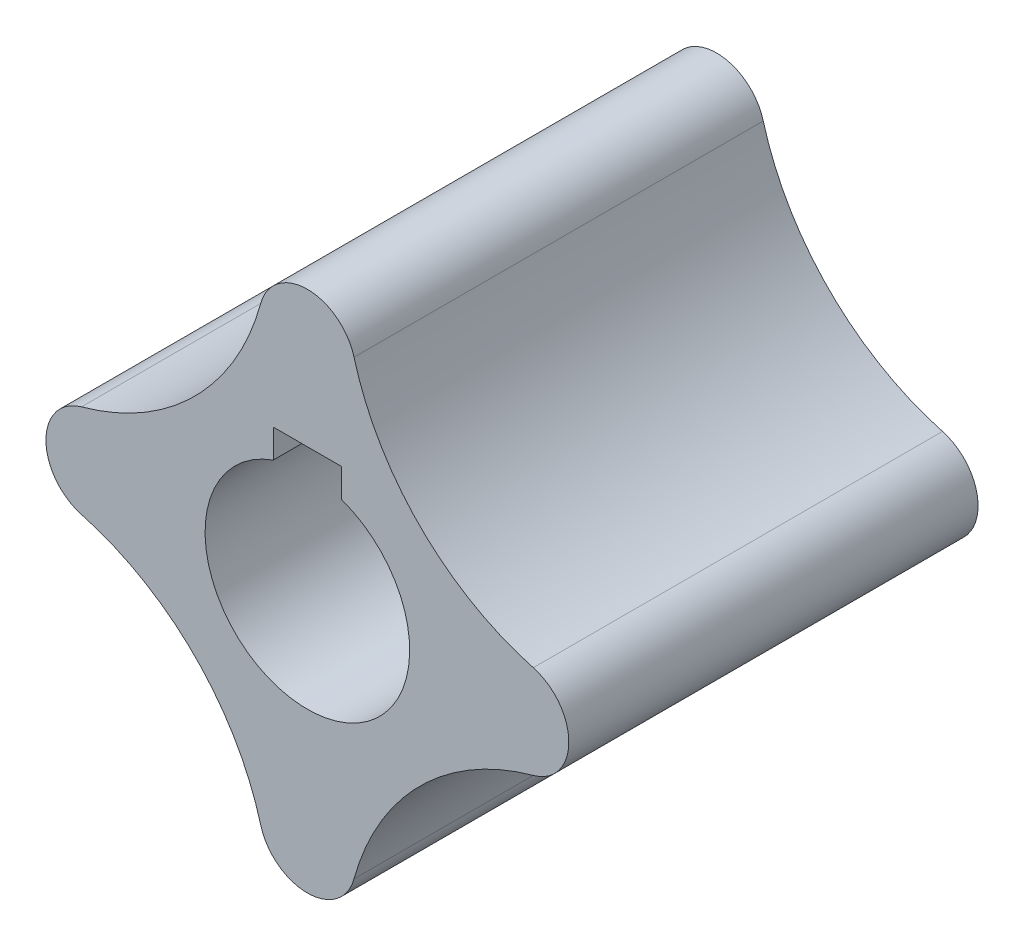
ISO-10303-21;
HEADER;
FILE_DESCRIPTION(('STEP AP214'),'2;1');
FILE_NAME('part.step','',(''),(''),'','','');
FILE_SCHEMA(('AUTOMOTIVE_DESIGN { 1 0 10303 214 1 1 1 1 }'));
ENDSEC;
DATA;
#1=APPLICATION_CONTEXT('core data for automotive mechanical design processes');
#2=APPLICATION_PROTOCOL_DEFINITION('international standard','automotive_design',2000,#1);
#3=PRODUCT_CONTEXT('',#1,'mechanical');
#4=PRODUCT('Part','Part','',(#3));
#5=PRODUCT_RELATED_PRODUCT_CATEGORY('part','',(#4));
#6=PRODUCT_DEFINITION_FORMATION('','',#4);
#7=PRODUCT_DEFINITION_CONTEXT('part definition',#1,'design');
#8=PRODUCT_DEFINITION('design','',#6,#7);
#9=PRODUCT_DEFINITION_SHAPE('','',#8);
#10=(LENGTH_UNIT() NAMED_UNIT(*) SI_UNIT(.MILLI.,.METRE.));
#11=(NAMED_UNIT(*) PLANE_ANGLE_UNIT() SI_UNIT($,.RADIAN.));
#12=(NAMED_UNIT(*) SI_UNIT($,.STERADIAN.) SOLID_ANGLE_UNIT());
#13=UNCERTAINTY_MEASURE_WITH_UNIT(LENGTH_MEASURE(1.E-05),#10,'distance_accuracy_value','');
#14=(GEOMETRIC_REPRESENTATION_CONTEXT(3) GLOBAL_UNCERTAINTY_ASSIGNED_CONTEXT((#13)) GLOBAL_UNIT_ASSIGNED_CONTEXT((#10,
#11,#12)) REPRESENTATION_CONTEXT('',''));
#15=CARTESIAN_POINT('',(0.,0.,0.));
#16=DIRECTION('',(0.,0.,1.));
#17=DIRECTION('',(1.,0.,0.));
#18=AXIS2_PLACEMENT_3D('',#15,#16,#17);
#19=CARTESIAN_POINT('',(-17.7881605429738,12.9154887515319,36.));
#20=DIRECTION('',(0.,0.,-1.));
#21=DIRECTION('',(-1.,0.,0.));
#22=AXIS2_PLACEMENT_3D('',#19,#20,#21);
#23=PLANE('',#22);
#24=CARTESIAN_POINT('',(-21.3309775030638,25.8309775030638,36.));
#25=DIRECTION('',(0.,0.,-1.));
#26=DIRECTION('',(-1.,0.,0.));
#27=AXIS2_PLACEMENT_3D('',#24,#25,#26);
#28=CIRCLE('',#27,22.5305187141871);
#29=CARTESIAN_POINT('',(0.39691186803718,19.8708519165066,36.));
#30=VERTEX_POINT('',#29);
#31=CARTESIAN_POINT('',(-15.3708519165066,4.10308813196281,36.));
#32=VERTEX_POINT('',#31);
#33=EDGE_CURVE('E156',#30,#32,#28,.T.);
#34=ORIENTED_EDGE('',*,*,#33,.T.);
#35=CARTESIAN_POINT('',(-14.2453435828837,0.,36.));
#36=DIRECTION('',(0.,0.,1.));
#37=DIRECTION('',(1.,0.,0.));
#38=AXIS2_PLACEMENT_3D('',#35,#36,#37);
#39=CIRCLE('',#38,4.25465641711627);
#40=CARTESIAN_POINT('',(-15.3708519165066,-4.10308813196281,36.));
#41=VERTEX_POINT('',#40);
#42=EDGE_CURVE('E159',#32,#41,#39,.T.);
#43=ORIENTED_EDGE('',*,*,#42,.T.);
#44=CARTESIAN_POINT('',(-21.3309775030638,-25.8309775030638,36.));
#45=DIRECTION('',(0.,0.,-1.));
#46=DIRECTION('',(1.,0.,0.));
#47=AXIS2_PLACEMENT_3D('',#44,#45,#46);
#48=CIRCLE('',#47,22.5305187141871);
#49=CARTESIAN_POINT('',(0.396911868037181,-19.8708519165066,36.));
#50=VERTEX_POINT('',#49);
#51=EDGE_CURVE('E162',#41,#50,#48,.T.);
#52=ORIENTED_EDGE('',*,*,#51,.T.);
#53=CARTESIAN_POINT('',(4.5,-18.7453435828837,36.));
#54=DIRECTION('',(0.,0.,1.));
#55=DIRECTION('',(-1.,0.,0.));
#56=AXIS2_PLACEMENT_3D('',#53,#54,#55);
#57=CIRCLE('',#56,4.25465641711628);
#58=CARTESIAN_POINT('',(8.60308813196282,-19.8708519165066,36.));
#59=VERTEX_POINT('',#58);
#60=EDGE_CURVE('E164',#50,#59,#57,.T.);
#61=ORIENTED_EDGE('',*,*,#60,.T.);
#62=CARTESIAN_POINT('',(30.3309775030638,-25.8309775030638,36.));
#63=DIRECTION('',(0.,0.,-1.));
#64=DIRECTION('',(-1.,0.,0.));
#65=AXIS2_PLACEMENT_3D('',#62,#63,#64);
#66=CIRCLE('',#65,22.5305187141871);
#67=CARTESIAN_POINT('',(24.3708519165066,-4.10308813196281,36.));
#68=VERTEX_POINT('',#67);
#69=EDGE_CURVE('E166',#59,#68,#66,.T.);
#70=ORIENTED_EDGE('',*,*,#69,.T.);
#71=CARTESIAN_POINT('',(23.2453435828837,0.,36.));
#72=DIRECTION('',(0.,0.,1.));
#73=DIRECTION('',(-1.,0.,0.));
#74=AXIS2_PLACEMENT_3D('',#71,#72,#73);
#75=CIRCLE('',#74,4.25465641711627);
#76=CARTESIAN_POINT('',(24.3708519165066,4.10308813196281,36.));
#77=VERTEX_POINT('',#76);
#78=EDGE_CURVE('E168',#68,#77,#75,.T.);
#79=ORIENTED_EDGE('',*,*,#78,.T.);
#80=CARTESIAN_POINT('',(30.3309775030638,25.8309775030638,36.));
#81=DIRECTION('',(0.,0.,-1.));
#82=DIRECTION('',(1.,0.,0.));
#83=AXIS2_PLACEMENT_3D('',#80,#81,#82);
#84=CIRCLE('',#83,22.5305187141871);
#85=CARTESIAN_POINT('',(8.60308813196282,19.8708519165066,36.));
#86=VERTEX_POINT('',#85);
#87=EDGE_CURVE('E170',#77,#86,#84,.T.);
#88=ORIENTED_EDGE('',*,*,#87,.T.);
#89=CARTESIAN_POINT('',(4.5,18.7453435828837,36.));
#90=DIRECTION('',(0.,0.,1.));
#91=DIRECTION('',(1.,0.,0.));
#92=AXIS2_PLACEMENT_3D('',#89,#90,#91);
#93=CIRCLE('',#92,4.25465641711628);
#94=EDGE_CURVE('E172',#86,#30,#93,.T.);
#95=ORIENTED_EDGE('',*,*,#94,.T.);
#96=EDGE_LOOP('',(#34,#43,#52,#61,#70,#79,#88,#95));
#97=FACE_BOUND('',#96,.T.);
#98=CARTESIAN_POINT('',(4.5,0.,36.));
#99=DIRECTION('',(0.,0.,1.));
#100=DIRECTION('',(1.,0.,0.));
#101=AXIS2_PLACEMENT_3D('',#98,#99,#100);
#102=CIRCLE('',#101,9.);
#103=CARTESIAN_POINT('',(1.5,8.48528137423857,36.));
#104=VERTEX_POINT('',#103);
#105=CARTESIAN_POINT('',(7.5,8.48528137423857,36.));
#106=VERTEX_POINT('',#105);
#107=EDGE_CURVE('E120',#104,#106,#102,.T.);
#108=ORIENTED_EDGE('',*,*,#107,.F.);
#109=DIRECTION('',(0.,-1.,0.));
#110=VECTOR('',#109,1.);
#111=CARTESIAN_POINT('',(1.5,8.48528137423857,36.));
#112=LINE('',#111,#110);
#113=CARTESIAN_POINT('',(1.5,11.,36.));
#114=VERTEX_POINT('',#113);
#115=EDGE_CURVE('E142',#114,#104,#112,.T.);
#116=ORIENTED_EDGE('',*,*,#115,.F.);
#117=DIRECTION('',(-1.,0.,0.));
#118=VECTOR('',#117,1.);
#119=CARTESIAN_POINT('',(1.5,11.,36.));
#120=LINE('',#119,#118);
#121=CARTESIAN_POINT('',(7.5,11.,36.));
#122=VERTEX_POINT('',#121);
#123=EDGE_CURVE('E140',#122,#114,#120,.T.);
#124=ORIENTED_EDGE('',*,*,#123,.F.);
#125=DIRECTION('',(0.,1.,0.));
#126=VECTOR('',#125,1.);
#127=CARTESIAN_POINT('',(7.5,11.,36.));
#128=LINE('',#127,#126);
#129=EDGE_CURVE('E128',#106,#122,#128,.T.);
#130=ORIENTED_EDGE('',*,*,#129,.F.);
#131=EDGE_LOOP('',(#108,#116,#124,#130));
#132=FACE_BOUND('',#131,.T.);
#133=ADVANCED_FACE('F31',(#97,#132),#23,.F.);
#134=CARTESIAN_POINT('',(-17.7881605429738,12.9154887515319,0.));
#135=DIRECTION('',(0.,0.,-1.));
#136=DIRECTION('',(-1.,0.,0.));
#137=AXIS2_PLACEMENT_3D('',#134,#135,#136);
#138=PLANE('',#137);
#139=CARTESIAN_POINT('',(-21.3309775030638,25.8309775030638,0.));
#140=DIRECTION('',(0.,0.,-1.));
#141=DIRECTION('',(-1.,0.,0.));
#142=AXIS2_PLACEMENT_3D('',#139,#140,#141);
#143=CIRCLE('',#142,22.5305187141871);
#144=CARTESIAN_POINT('',(0.39691186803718,19.8708519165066,0.));
#145=VERTEX_POINT('',#144);
#146=CARTESIAN_POINT('',(-15.3708519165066,4.10308813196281,0.));
#147=VERTEX_POINT('',#146);
#148=EDGE_CURVE('E136',#145,#147,#143,.T.);
#149=ORIENTED_EDGE('',*,*,#148,.F.);
#150=CARTESIAN_POINT('',(4.5,18.7453435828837,0.));
#151=DIRECTION('',(0.,0.,1.));
#152=DIRECTION('',(1.,0.,0.));
#153=AXIS2_PLACEMENT_3D('',#150,#151,#152);
#154=CIRCLE('',#153,4.25465641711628);
#155=CARTESIAN_POINT('',(8.60308813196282,19.8708519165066,0.));
#156=VERTEX_POINT('',#155);
#157=EDGE_CURVE('E160',#156,#145,#154,.T.);
#158=ORIENTED_EDGE('',*,*,#157,.F.);
#159=CARTESIAN_POINT('',(30.3309775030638,25.8309775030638,0.));
#160=DIRECTION('',(0.,0.,-1.));
#161=DIRECTION('',(1.,0.,0.));
#162=AXIS2_PLACEMENT_3D('',#159,#160,#161);
#163=CIRCLE('',#162,22.5305187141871);
#164=CARTESIAN_POINT('',(24.3708519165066,4.10308813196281,0.));
#165=VERTEX_POINT('',#164);
#166=EDGE_CURVE('E187',#165,#156,#163,.T.);
#167=ORIENTED_EDGE('',*,*,#166,.F.);
#168=CARTESIAN_POINT('',(23.2453435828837,0.,0.));
#169=DIRECTION('',(0.,0.,1.));
#170=DIRECTION('',(-1.,0.,0.));
#171=AXIS2_PLACEMENT_3D('',#168,#169,#170);
#172=CIRCLE('',#171,4.25465641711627);
#173=CARTESIAN_POINT('',(24.3708519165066,-4.10308813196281,0.));
#174=VERTEX_POINT('',#173);
#175=EDGE_CURVE('E185',#174,#165,#172,.T.);
#176=ORIENTED_EDGE('',*,*,#175,.F.);
#177=CARTESIAN_POINT('',(30.3309775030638,-25.8309775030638,0.));
#178=DIRECTION('',(0.,0.,-1.));
#179=DIRECTION('',(-1.,0.,0.));
#180=AXIS2_PLACEMENT_3D('',#177,#178,#179);
#181=CIRCLE('',#180,22.5305187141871);
#182=CARTESIAN_POINT('',(8.60308813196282,-19.8708519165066,0.));
#183=VERTEX_POINT('',#182);
#184=EDGE_CURVE('E183',#183,#174,#181,.T.);
#185=ORIENTED_EDGE('',*,*,#184,.F.);
#186=CARTESIAN_POINT('',(4.5,-18.7453435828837,0.));
#187=DIRECTION('',(0.,0.,1.));
#188=DIRECTION('',(-1.,0.,0.));
#189=AXIS2_PLACEMENT_3D('',#186,#187,#188);
#190=CIRCLE('',#189,4.25465641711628);
#191=CARTESIAN_POINT('',(0.396911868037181,-19.8708519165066,0.));
#192=VERTEX_POINT('',#191);
#193=EDGE_CURVE('E181',#192,#183,#190,.T.);
#194=ORIENTED_EDGE('',*,*,#193,.F.);
#195=CARTESIAN_POINT('',(-21.3309775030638,-25.8309775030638,0.));
#196=DIRECTION('',(0.,0.,-1.));
#197=DIRECTION('',(1.,0.,0.));
#198=AXIS2_PLACEMENT_3D('',#195,#196,#197);
#199=CIRCLE('',#198,22.5305187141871);
#200=CARTESIAN_POINT('',(-15.3708519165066,-4.10308813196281,0.));
#201=VERTEX_POINT('',#200);
#202=EDGE_CURVE('E179',#201,#192,#199,.T.);
#203=ORIENTED_EDGE('',*,*,#202,.F.);
#204=CARTESIAN_POINT('',(-14.2453435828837,0.,0.));
#205=DIRECTION('',(0.,0.,1.));
#206=DIRECTION('',(1.,0.,0.));
#207=AXIS2_PLACEMENT_3D('',#204,#205,#206);
#208=CIRCLE('',#207,4.25465641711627);
#209=EDGE_CURVE('E177',#147,#201,#208,.T.);
#210=ORIENTED_EDGE('',*,*,#209,.F.);
#211=EDGE_LOOP('',(#149,#158,#167,#176,#185,#194,#203,#210));
#212=FACE_BOUND('',#211,.T.);
#213=DIRECTION('',(0.,-1.,0.));
#214=VECTOR('',#213,1.);
#215=CARTESIAN_POINT('',(1.5,8.48528137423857,0.));
#216=LINE('',#215,#214);
#217=CARTESIAN_POINT('',(1.5,11.,0.));
#218=VERTEX_POINT('',#217);
#219=CARTESIAN_POINT('',(1.5,8.48528137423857,0.));
#220=VERTEX_POINT('',#219);
#221=EDGE_CURVE('E129',#218,#220,#216,.T.);
#222=ORIENTED_EDGE('',*,*,#221,.T.);
#223=CARTESIAN_POINT('',(4.5,0.,0.));
#224=DIRECTION('',(0.,0.,1.));
#225=DIRECTION('',(1.,0.,0.));
#226=AXIS2_PLACEMENT_3D('',#223,#224,#225);
#227=CIRCLE('',#226,9.);
#228=CARTESIAN_POINT('',(7.5,8.48528137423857,0.));
#229=VERTEX_POINT('',#228);
#230=EDGE_CURVE('E54',#220,#229,#227,.T.);
#231=ORIENTED_EDGE('',*,*,#230,.T.);
#232=DIRECTION('',(0.,1.,0.));
#233=VECTOR('',#232,1.);
#234=CARTESIAN_POINT('',(7.5,11.,0.));
#235=LINE('',#234,#233);
#236=CARTESIAN_POINT('',(7.5,11.,0.));
#237=VERTEX_POINT('',#236);
#238=EDGE_CURVE('E135',#229,#237,#235,.T.);
#239=ORIENTED_EDGE('',*,*,#238,.T.);
#240=DIRECTION('',(-1.,0.,0.));
#241=VECTOR('',#240,1.);
#242=CARTESIAN_POINT('',(1.5,11.,0.));
#243=LINE('',#242,#241);
#244=EDGE_CURVE('E148',#237,#218,#243,.T.);
#245=ORIENTED_EDGE('',*,*,#244,.T.);
#246=EDGE_LOOP('',(#222,#231,#239,#245));
#247=FACE_BOUND('',#246,.T.);
#248=ADVANCED_FACE('F217',(#212,#247),#138,.T.);
#249=CARTESIAN_POINT('',(-21.3309775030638,25.8309775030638,36.));
#250=DIRECTION('',(0.,0.,-1.));
#251=DIRECTION('',(-1.,0.,0.));
#252=AXIS2_PLACEMENT_3D('',#249,#250,#251);
#253=CYLINDRICAL_SURFACE('',#252,22.5305187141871);
#254=ORIENTED_EDGE('',*,*,#148,.T.);
#255=DIRECTION('',(0.,0.,-1.));
#256=VECTOR('',#255,1.);
#257=CARTESIAN_POINT('',(-15.3708519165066,4.10308813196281,36.));
#258=LINE('',#257,#256);
#259=EDGE_CURVE('E11',#32,#147,#258,.T.);
#260=ORIENTED_EDGE('',*,*,#259,.F.);
#261=ORIENTED_EDGE('',*,*,#33,.F.);
#262=DIRECTION('',(0.,0.,-1.));
#263=VECTOR('',#262,1.);
#264=CARTESIAN_POINT('',(0.39691186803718,19.8708519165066,36.));
#265=LINE('',#264,#263);
#266=EDGE_CURVE('E174',#30,#145,#265,.T.);
#267=ORIENTED_EDGE('',*,*,#266,.T.);
#268=EDGE_LOOP('',(#254,#260,#261,#267));
#269=FACE_BOUND('',#268,.T.);
#270=ADVANCED_FACE('F33',(#269),#253,.F.);
#271=CARTESIAN_POINT('',(-14.2453435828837,0.,36.));
#272=DIRECTION('',(0.,0.,-1.));
#273=DIRECTION('',(-1.,0.,0.));
#274=AXIS2_PLACEMENT_3D('',#271,#272,#273);
#275=CYLINDRICAL_SURFACE('',#274,4.25465641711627);
#276=ORIENTED_EDGE('',*,*,#209,.T.);
#277=DIRECTION('',(0.,0.,-1.));
#278=VECTOR('',#277,1.);
#279=CARTESIAN_POINT('',(-15.3708519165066,-4.10308813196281,36.));
#280=LINE('',#279,#278);
#281=EDGE_CURVE('E39',#41,#201,#280,.T.);
#282=ORIENTED_EDGE('',*,*,#281,.F.);
#283=ORIENTED_EDGE('',*,*,#42,.F.);
#284=ORIENTED_EDGE('',*,*,#259,.T.);
#285=EDGE_LOOP('',(#276,#282,#283,#284));
#286=FACE_BOUND('',#285,.T.);
#287=ADVANCED_FACE('F234',(#286),#275,.T.);
#288=CARTESIAN_POINT('',(-21.3309775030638,-25.8309775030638,36.));
#289=DIRECTION('',(0.,0.,-1.));
#290=DIRECTION('',(-1.,0.,0.));
#291=AXIS2_PLACEMENT_3D('',#288,#289,#290);
#292=CYLINDRICAL_SURFACE('',#291,22.5305187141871);
#293=ORIENTED_EDGE('',*,*,#202,.T.);
#294=DIRECTION('',(0.,0.,-1.));
#295=VECTOR('',#294,1.);
#296=CARTESIAN_POINT('',(0.396911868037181,-19.8708519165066,36.));
#297=LINE('',#296,#295);
#298=EDGE_CURVE('E204',#50,#192,#297,.T.);
#299=ORIENTED_EDGE('',*,*,#298,.F.);
#300=ORIENTED_EDGE('',*,*,#51,.F.);
#301=ORIENTED_EDGE('',*,*,#281,.T.);
#302=EDGE_LOOP('',(#293,#299,#300,#301));
#303=FACE_BOUND('',#302,.T.);
#304=ADVANCED_FACE('F211',(#303),#292,.F.);
#305=CARTESIAN_POINT('',(4.5,-18.7453435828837,36.));
#306=DIRECTION('',(0.,0.,-1.));
#307=DIRECTION('',(-1.,0.,0.));
#308=AXIS2_PLACEMENT_3D('',#305,#306,#307);
#309=CYLINDRICAL_SURFACE('',#308,4.25465641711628);
#310=ORIENTED_EDGE('',*,*,#193,.T.);
#311=DIRECTION('',(0.,0.,-1.));
#312=VECTOR('',#311,1.);
#313=CARTESIAN_POINT('',(8.60308813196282,-19.8708519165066,36.));
#314=LINE('',#313,#312);
#315=EDGE_CURVE('E201',#59,#183,#314,.T.);
#316=ORIENTED_EDGE('',*,*,#315,.F.);
#317=ORIENTED_EDGE('',*,*,#60,.F.);
#318=ORIENTED_EDGE('',*,*,#298,.T.);
#319=EDGE_LOOP('',(#310,#316,#317,#318));
#320=FACE_BOUND('',#319,.T.);
#321=ADVANCED_FACE('F223',(#320),#309,.T.);
#322=CARTESIAN_POINT('',(30.3309775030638,-25.8309775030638,36.));
#323=DIRECTION('',(0.,0.,-1.));
#324=DIRECTION('',(-1.,0.,0.));
#325=AXIS2_PLACEMENT_3D('',#322,#323,#324);
#326=CYLINDRICAL_SURFACE('',#325,22.5305187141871);
#327=ORIENTED_EDGE('',*,*,#184,.T.);
#328=DIRECTION('',(0.,0.,-1.));
#329=VECTOR('',#328,1.);
#330=CARTESIAN_POINT('',(24.3708519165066,-4.10308813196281,36.));
#331=LINE('',#330,#329);
#332=EDGE_CURVE('E198',#68,#174,#331,.T.);
#333=ORIENTED_EDGE('',*,*,#332,.F.);
#334=ORIENTED_EDGE('',*,*,#69,.F.);
#335=ORIENTED_EDGE('',*,*,#315,.T.);
#336=EDGE_LOOP('',(#327,#333,#334,#335));
#337=FACE_BOUND('',#336,.T.);
#338=ADVANCED_FACE('F227',(#337),#326,.F.);
#339=CARTESIAN_POINT('',(23.2453435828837,0.,36.));
#340=DIRECTION('',(0.,0.,-1.));
#341=DIRECTION('',(-1.,0.,0.));
#342=AXIS2_PLACEMENT_3D('',#339,#340,#341);
#343=CYLINDRICAL_SURFACE('',#342,4.25465641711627);
#344=ORIENTED_EDGE('',*,*,#175,.T.);
#345=DIRECTION('',(0.,0.,-1.));
#346=VECTOR('',#345,1.);
#347=CARTESIAN_POINT('',(24.3708519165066,4.10308813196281,36.));
#348=LINE('',#347,#346);
#349=EDGE_CURVE('E195',#77,#165,#348,.T.);
#350=ORIENTED_EDGE('',*,*,#349,.F.);
#351=ORIENTED_EDGE('',*,*,#78,.F.);
#352=ORIENTED_EDGE('',*,*,#332,.T.);
#353=EDGE_LOOP('',(#344,#350,#351,#352));
#354=FACE_BOUND('',#353,.T.);
#355=ADVANCED_FACE('F247',(#354),#343,.T.);
#356=CARTESIAN_POINT('',(30.3309775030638,25.8309775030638,36.));
#357=DIRECTION('',(0.,0.,-1.));
#358=DIRECTION('',(-1.,0.,0.));
#359=AXIS2_PLACEMENT_3D('',#356,#357,#358);
#360=CYLINDRICAL_SURFACE('',#359,22.5305187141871);
#361=ORIENTED_EDGE('',*,*,#166,.T.);
#362=DIRECTION('',(0.,0.,-1.));
#363=VECTOR('',#362,1.);
#364=CARTESIAN_POINT('',(8.60308813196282,19.8708519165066,36.));
#365=LINE('',#364,#363);
#366=EDGE_CURVE('E192',#86,#156,#365,.T.);
#367=ORIENTED_EDGE('',*,*,#366,.F.);
#368=ORIENTED_EDGE('',*,*,#87,.F.);
#369=ORIENTED_EDGE('',*,*,#349,.T.);
#370=EDGE_LOOP('',(#361,#367,#368,#369));
#371=FACE_BOUND('',#370,.T.);
#372=ADVANCED_FACE('F245',(#371),#360,.F.);
#373=CARTESIAN_POINT('',(4.5,18.7453435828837,36.));
#374=DIRECTION('',(0.,0.,-1.));
#375=DIRECTION('',(-1.,0.,0.));
#376=AXIS2_PLACEMENT_3D('',#373,#374,#375);
#377=CYLINDRICAL_SURFACE('',#376,4.25465641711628);
#378=ORIENTED_EDGE('',*,*,#157,.T.);
#379=ORIENTED_EDGE('',*,*,#266,.F.);
#380=ORIENTED_EDGE('',*,*,#94,.F.);
#381=ORIENTED_EDGE('',*,*,#366,.T.);
#382=EDGE_LOOP('',(#378,#379,#380,#381));
#383=FACE_BOUND('',#382,.T.);
#384=ADVANCED_FACE('F240',(#383),#377,.T.);
#385=CARTESIAN_POINT('',(4.5,0.,36.));
#386=DIRECTION('',(0.,0.,-1.));
#387=DIRECTION('',(-1.,0.,0.));
#388=AXIS2_PLACEMENT_3D('',#385,#386,#387);
#389=CYLINDRICAL_SURFACE('',#388,9.);
#390=ORIENTED_EDGE('',*,*,#230,.F.);
#391=DIRECTION('',(0.,0.,-1.));
#392=VECTOR('',#391,1.);
#393=CARTESIAN_POINT('',(1.5,8.48528137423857,36.));
#394=LINE('',#393,#392);
#395=EDGE_CURVE('E124',#104,#220,#394,.T.);
#396=ORIENTED_EDGE('',*,*,#395,.F.);
#397=ORIENTED_EDGE('',*,*,#107,.T.);
#398=DIRECTION('',(0.,0.,-1.));
#399=VECTOR('',#398,1.);
#400=CARTESIAN_POINT('',(7.5,8.48528137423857,36.));
#401=LINE('',#400,#399);
#402=EDGE_CURVE('E123',#106,#229,#401,.T.);
#403=ORIENTED_EDGE('',*,*,#402,.T.);
#404=EDGE_LOOP('',(#390,#396,#397,#403));
#405=FACE_BOUND('',#404,.T.);
#406=ADVANCED_FACE('F122',(#405),#389,.F.);
#407=CARTESIAN_POINT('',(7.5,11.,36.));
#408=DIRECTION('',(-1.,0.,0.));
#409=DIRECTION('',(0.,0.,1.));
#410=AXIS2_PLACEMENT_3D('',#407,#408,#409);
#411=PLANE('',#410);
#412=ORIENTED_EDGE('',*,*,#238,.F.);
#413=ORIENTED_EDGE('',*,*,#402,.F.);
#414=ORIENTED_EDGE('',*,*,#129,.T.);
#415=DIRECTION('',(0.,0.,-1.));
#416=VECTOR('',#415,1.);
#417=CARTESIAN_POINT('',(7.5,11.,36.));
#418=LINE('',#417,#416);
#419=EDGE_CURVE('E137',#122,#237,#418,.T.);
#420=ORIENTED_EDGE('',*,*,#419,.T.);
#421=EDGE_LOOP('',(#412,#413,#414,#420));
#422=FACE_BOUND('',#421,.T.);
#423=ADVANCED_FACE('F132',(#422),#411,.T.);
#424=CARTESIAN_POINT('',(1.5,11.,36.));
#425=DIRECTION('',(0.,-1.,0.));
#426=DIRECTION('',(0.,0.,-1.));
#427=AXIS2_PLACEMENT_3D('',#424,#425,#426);
#428=PLANE('',#427);
#429=ORIENTED_EDGE('',*,*,#244,.F.);
#430=ORIENTED_EDGE('',*,*,#419,.F.);
#431=ORIENTED_EDGE('',*,*,#123,.T.);
#432=DIRECTION('',(0.,0.,-1.));
#433=VECTOR('',#432,1.);
#434=CARTESIAN_POINT('',(1.5,11.,36.));
#435=LINE('',#434,#433);
#436=EDGE_CURVE('E46',#114,#218,#435,.T.);
#437=ORIENTED_EDGE('',*,*,#436,.T.);
#438=EDGE_LOOP('',(#429,#430,#431,#437));
#439=FACE_BOUND('',#438,.T.);
#440=ADVANCED_FACE('F272',(#439),#428,.T.);
#441=CARTESIAN_POINT('',(1.5,8.48528137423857,36.));
#442=DIRECTION('',(1.,0.,0.));
#443=DIRECTION('',(0.,0.,-1.));
#444=AXIS2_PLACEMENT_3D('',#441,#442,#443);
#445=PLANE('',#444);
#446=ORIENTED_EDGE('',*,*,#221,.F.);
#447=ORIENTED_EDGE('',*,*,#436,.F.);
#448=ORIENTED_EDGE('',*,*,#115,.T.);
#449=ORIENTED_EDGE('',*,*,#395,.T.);
#450=EDGE_LOOP('',(#446,#447,#448,#449));
#451=FACE_BOUND('',#450,.T.);
#452=ADVANCED_FACE('F276',(#451),#445,.T.);
#453=CLOSED_SHELL('',(#133,#248,#270,#287,#304,#321,#338,#355,#372,#384,#406,#423,#440,#452));
#454=MANIFOLD_SOLID_BREP('B2',#453);
#455=ADVANCED_BREP_SHAPE_REPRESENTATION('',(#18,#454),#14);
#456=SHAPE_DEFINITION_REPRESENTATION(#9,#455);
ENDSEC;
END-ISO-10303-21;
